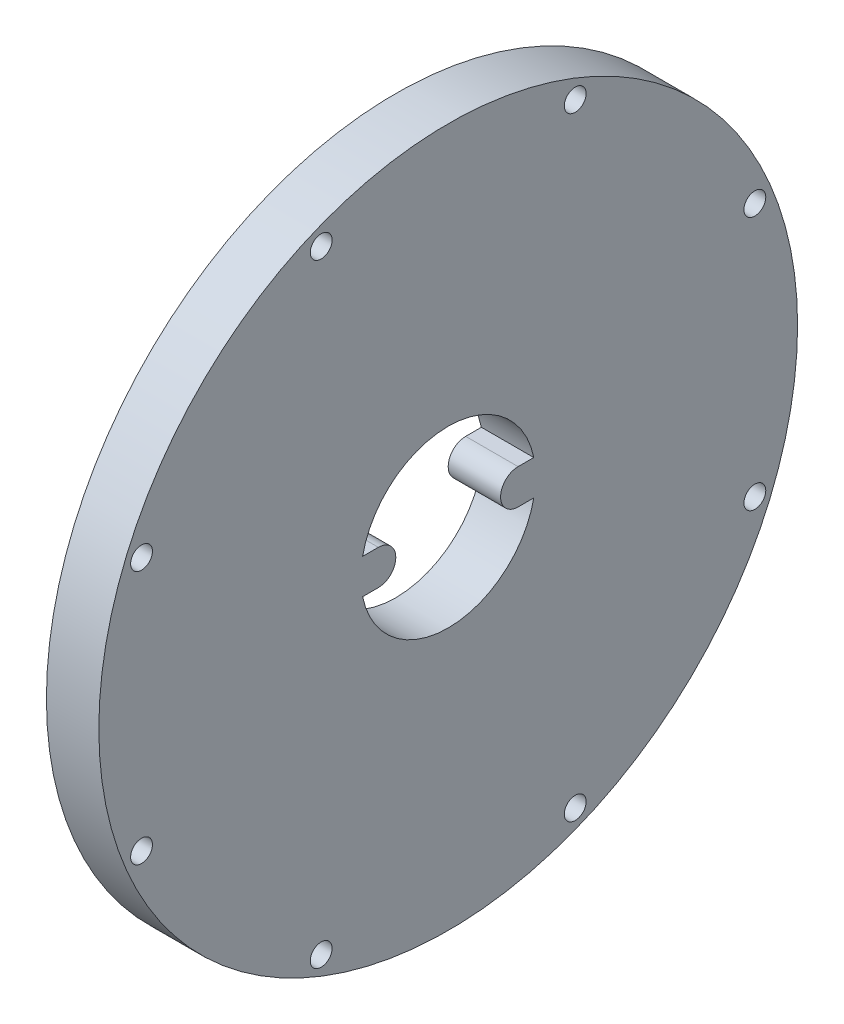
ISO-10303-21;
HEADER;
FILE_DESCRIPTION(('STEP AP214'),'2;1');
FILE_NAME('part.step','',(''),(''),'','','');
FILE_SCHEMA(('AUTOMOTIVE_DESIGN { 1 0 10303 214 1 1 1 1 }'));
ENDSEC;
DATA;
#1=APPLICATION_CONTEXT('core data for automotive mechanical design processes');
#2=APPLICATION_PROTOCOL_DEFINITION('international standard','automotive_design',2000,#1);
#3=PRODUCT_CONTEXT('',#1,'mechanical');
#4=PRODUCT('Part','Part','',(#3));
#5=PRODUCT_RELATED_PRODUCT_CATEGORY('part','',(#4));
#6=PRODUCT_DEFINITION_FORMATION('','',#4);
#7=PRODUCT_DEFINITION_CONTEXT('part definition',#1,'design');
#8=PRODUCT_DEFINITION('design','',#6,#7);
#9=PRODUCT_DEFINITION_SHAPE('','',#8);
#10=(LENGTH_UNIT() NAMED_UNIT(*) SI_UNIT(.MILLI.,.METRE.));
#11=(NAMED_UNIT(*) PLANE_ANGLE_UNIT() SI_UNIT($,.RADIAN.));
#12=(NAMED_UNIT(*) SI_UNIT($,.STERADIAN.) SOLID_ANGLE_UNIT());
#13=UNCERTAINTY_MEASURE_WITH_UNIT(LENGTH_MEASURE(1.E-05),#10,'distance_accuracy_value','');
#14=(GEOMETRIC_REPRESENTATION_CONTEXT(3) GLOBAL_UNCERTAINTY_ASSIGNED_CONTEXT((#13)) GLOBAL_UNIT_ASSIGNED_CONTEXT((#10,
#11,#12)) REPRESENTATION_CONTEXT('',''));
#15=CARTESIAN_POINT('',(0.,0.,0.));
#16=DIRECTION('',(0.,0.,1.));
#17=DIRECTION('',(1.,0.,0.));
#18=AXIS2_PLACEMENT_3D('',#15,#16,#17);
#19=CARTESIAN_POINT('',(12.,70.2148444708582,29.0839408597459));
#20=DIRECTION('',(-1.,0.,0.));
#21=DIRECTION('',(0.,0.,1.));
#22=AXIS2_PLACEMENT_3D('',#19,#20,#21);
#23=CYLINDRICAL_SURFACE('',#22,1.5);
#24=CARTESIAN_POINT('',(0.,70.2148444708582,29.0839408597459));
#25=DIRECTION('',(1.,0.,0.));
#26=DIRECTION('',(0.,0.,-1.));
#27=AXIS2_PLACEMENT_3D('',#24,#25,#26);
#28=CIRCLE('',#27,1.5);
#29=CARTESIAN_POINT('',(0.,70.2148444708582,27.5839408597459));
#30=VERTEX_POINT('',#29);
#31=EDGE_CURVE('E176',#30,#30,#28,.T.);
#32=ORIENTED_EDGE('',*,*,#31,.F.);
#33=EDGE_LOOP('',(#32));
#34=FACE_BOUND('',#33,.T.);
#35=CARTESIAN_POINT('',(7.,70.2148444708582,29.0839408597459));
#36=DIRECTION('',(1.,0.,0.));
#37=DIRECTION('',(0.,0.,-1.));
#38=AXIS2_PLACEMENT_3D('',#35,#36,#37);
#39=CIRCLE('',#38,1.5);
#40=CARTESIAN_POINT('',(7.,70.2148444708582,27.5839408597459));
#41=VERTEX_POINT('',#40);
#42=EDGE_CURVE('E41',#41,#41,#39,.T.);
#43=ORIENTED_EDGE('',*,*,#42,.T.);
#44=EDGE_LOOP('',(#43));
#45=FACE_BOUND('',#44,.T.);
#46=ADVANCED_FACE('F37',(#34,#45),#23,.F.);
#47=CARTESIAN_POINT('',(12.,29.0839408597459,70.2148444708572));
#48=DIRECTION('',(-1.,0.,0.));
#49=DIRECTION('',(0.,0.,1.));
#50=AXIS2_PLACEMENT_3D('',#47,#48,#49);
#51=CYLINDRICAL_SURFACE('',#50,1.50000000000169);
#52=CARTESIAN_POINT('',(0.,29.0839408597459,70.2148444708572));
#53=DIRECTION('',(1.,0.,0.));
#54=DIRECTION('',(0.,0.,-1.));
#55=AXIS2_PLACEMENT_3D('',#52,#53,#54);
#56=CIRCLE('',#55,1.50000000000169);
#57=CARTESIAN_POINT('',(0.,29.0839408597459,68.7148444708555));
#58=VERTEX_POINT('',#57);
#59=EDGE_CURVE('E245',#58,#58,#56,.T.);
#60=ORIENTED_EDGE('',*,*,#59,.F.);
#61=EDGE_LOOP('',(#60));
#62=FACE_BOUND('',#61,.T.);
#63=CARTESIAN_POINT('',(7.,29.0839408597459,70.2148444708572));
#64=DIRECTION('',(1.,0.,0.));
#65=DIRECTION('',(0.,0.,-1.));
#66=AXIS2_PLACEMENT_3D('',#63,#64,#65);
#67=CIRCLE('',#66,1.50000000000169);
#68=CARTESIAN_POINT('',(7.,29.0839408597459,68.7148444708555));
#69=VERTEX_POINT('',#68);
#70=EDGE_CURVE('E202',#69,#69,#67,.T.);
#71=ORIENTED_EDGE('',*,*,#70,.T.);
#72=EDGE_LOOP('',(#71));
#73=FACE_BOUND('',#72,.T.);
#74=ADVANCED_FACE('F312',(#62,#73),#51,.F.);
#75=CARTESIAN_POINT('',(12.,-29.0839408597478,70.2148444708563));
#76=DIRECTION('',(-1.,0.,0.));
#77=DIRECTION('',(0.,0.,1.));
#78=AXIS2_PLACEMENT_3D('',#75,#76,#77);
#79=CYLINDRICAL_SURFACE('',#78,1.50000000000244);
#80=CARTESIAN_POINT('',(0.,-29.0839408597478,70.2148444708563));
#81=DIRECTION('',(1.,0.,0.));
#82=DIRECTION('',(0.,0.,-1.));
#83=AXIS2_PLACEMENT_3D('',#80,#81,#82);
#84=CIRCLE('',#83,1.50000000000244);
#85=CARTESIAN_POINT('',(0.,-29.0839408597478,68.7148444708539));
#86=VERTEX_POINT('',#85);
#87=EDGE_CURVE('E248',#86,#86,#84,.T.);
#88=ORIENTED_EDGE('',*,*,#87,.F.);
#89=EDGE_LOOP('',(#88));
#90=FACE_BOUND('',#89,.T.);
#91=CARTESIAN_POINT('',(7.,-29.0839408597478,70.2148444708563));
#92=DIRECTION('',(1.,0.,0.));
#93=DIRECTION('',(0.,0.,-1.));
#94=AXIS2_PLACEMENT_3D('',#91,#92,#93);
#95=CIRCLE('',#94,1.50000000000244);
#96=CARTESIAN_POINT('',(7.,-29.0839408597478,68.7148444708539));
#97=VERTEX_POINT('',#96);
#98=EDGE_CURVE('E198',#97,#97,#95,.T.);
#99=ORIENTED_EDGE('',*,*,#98,.T.);
#100=EDGE_LOOP('',(#99));
#101=FACE_BOUND('',#100,.T.);
#102=ADVANCED_FACE('F353',(#90,#101),#79,.F.);
#103=CARTESIAN_POINT('',(12.,-70.2148444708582,29.0839408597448));
#104=DIRECTION('',(-1.,0.,0.));
#105=DIRECTION('',(0.,0.,1.));
#106=AXIS2_PLACEMENT_3D('',#103,#104,#105);
#107=CYLINDRICAL_SURFACE('',#106,1.50000000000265);
#108=CARTESIAN_POINT('',(0.,-70.2148444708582,29.0839408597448));
#109=DIRECTION('',(1.,0.,0.));
#110=DIRECTION('',(0.,0.,-1.));
#111=AXIS2_PLACEMENT_3D('',#108,#109,#110);
#112=CIRCLE('',#111,1.50000000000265);
#113=CARTESIAN_POINT('',(0.,-70.2148444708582,27.5839408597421));
#114=VERTEX_POINT('',#113);
#115=EDGE_CURVE('E251',#114,#114,#112,.T.);
#116=ORIENTED_EDGE('',*,*,#115,.F.);
#117=EDGE_LOOP('',(#116));
#118=FACE_BOUND('',#117,.T.);
#119=CARTESIAN_POINT('',(7.,-70.2148444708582,29.0839408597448));
#120=DIRECTION('',(1.,0.,0.));
#121=DIRECTION('',(0.,0.,-1.));
#122=AXIS2_PLACEMENT_3D('',#119,#120,#121);
#123=CIRCLE('',#122,1.50000000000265);
#124=CARTESIAN_POINT('',(7.,-70.2148444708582,27.5839408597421));
#125=VERTEX_POINT('',#124);
#126=EDGE_CURVE('E193',#125,#125,#123,.T.);
#127=ORIENTED_EDGE('',*,*,#126,.T.);
#128=EDGE_LOOP('',(#127));
#129=FACE_BOUND('',#128,.T.);
#130=ADVANCED_FACE('F357',(#118,#129),#107,.F.);
#131=CARTESIAN_POINT('',(12.,-70.2148444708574,-29.0839408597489));
#132=DIRECTION('',(-1.,0.,0.));
#133=DIRECTION('',(0.,0.,1.));
#134=AXIS2_PLACEMENT_3D('',#131,#132,#133);
#135=CYLINDRICAL_SURFACE('',#134,1.50000000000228);
#136=CARTESIAN_POINT('',(0.,-70.2148444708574,-29.0839408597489));
#137=DIRECTION('',(1.,0.,0.));
#138=DIRECTION('',(0.,0.,-1.));
#139=AXIS2_PLACEMENT_3D('',#136,#137,#138);
#140=CIRCLE('',#139,1.50000000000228);
#141=CARTESIAN_POINT('',(0.,-70.2148444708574,-30.5839408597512));
#142=VERTEX_POINT('',#141);
#143=EDGE_CURVE('E254',#142,#142,#140,.T.);
#144=ORIENTED_EDGE('',*,*,#143,.F.);
#145=EDGE_LOOP('',(#144));
#146=FACE_BOUND('',#145,.T.);
#147=CARTESIAN_POINT('',(7.,-70.2148444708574,-29.0839408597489));
#148=DIRECTION('',(1.,0.,0.));
#149=DIRECTION('',(0.,0.,-1.));
#150=AXIS2_PLACEMENT_3D('',#147,#148,#149);
#151=CIRCLE('',#150,1.50000000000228);
#152=CARTESIAN_POINT('',(7.,-70.2148444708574,-30.5839408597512));
#153=VERTEX_POINT('',#152);
#154=EDGE_CURVE('E188',#153,#153,#151,.T.);
#155=ORIENTED_EDGE('',*,*,#154,.T.);
#156=EDGE_LOOP('',(#155));
#157=FACE_BOUND('',#156,.T.);
#158=ADVANCED_FACE('F361',(#146,#157),#135,.F.);
#159=CARTESIAN_POINT('',(12.,-29.0839408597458,-70.2148444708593));
#160=DIRECTION('',(-1.,0.,0.));
#161=DIRECTION('',(0.,0.,1.));
#162=AXIS2_PLACEMENT_3D('',#159,#160,#161);
#163=CYLINDRICAL_SURFACE('',#162,1.50000000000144);
#164=CARTESIAN_POINT('',(0.,-29.0839408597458,-70.2148444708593));
#165=DIRECTION('',(1.,0.,0.));
#166=DIRECTION('',(0.,0.,-1.));
#167=AXIS2_PLACEMENT_3D('',#164,#165,#166);
#168=CIRCLE('',#167,1.50000000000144);
#169=CARTESIAN_POINT('',(0.,-29.0839408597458,-71.7148444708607));
#170=VERTEX_POINT('',#169);
#171=EDGE_CURVE('E257',#170,#170,#168,.T.);
#172=ORIENTED_EDGE('',*,*,#171,.F.);
#173=EDGE_LOOP('',(#172));
#174=FACE_BOUND('',#173,.T.);
#175=CARTESIAN_POINT('',(7.,-29.0839408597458,-70.2148444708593));
#176=DIRECTION('',(1.,0.,0.));
#177=DIRECTION('',(0.,0.,-1.));
#178=AXIS2_PLACEMENT_3D('',#175,#176,#177);
#179=CIRCLE('',#178,1.50000000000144);
#180=CARTESIAN_POINT('',(7.,-29.0839408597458,-71.7148444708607));
#181=VERTEX_POINT('',#180);
#182=EDGE_CURVE('E183',#181,#181,#179,.T.);
#183=ORIENTED_EDGE('',*,*,#182,.T.);
#184=EDGE_LOOP('',(#183));
#185=FACE_BOUND('',#184,.T.);
#186=ADVANCED_FACE('F365',(#174,#185),#163,.F.);
#187=CARTESIAN_POINT('',(12.,29.0839408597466,-70.2148444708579));
#188=DIRECTION('',(-1.,0.,0.));
#189=DIRECTION('',(0.,0.,1.));
#190=AXIS2_PLACEMENT_3D('',#187,#188,#189);
#191=CYLINDRICAL_SURFACE('',#190,1.5);
#192=CARTESIAN_POINT('',(0.,29.0839408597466,-70.2148444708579));
#193=DIRECTION('',(1.,0.,0.));
#194=DIRECTION('',(0.,0.,-1.));
#195=AXIS2_PLACEMENT_3D('',#192,#193,#194);
#196=CIRCLE('',#195,1.5);
#197=CARTESIAN_POINT('',(0.,29.0839408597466,-71.7148444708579));
#198=VERTEX_POINT('',#197);
#199=EDGE_CURVE('E260',#198,#198,#196,.T.);
#200=ORIENTED_EDGE('',*,*,#199,.F.);
#201=EDGE_LOOP('',(#200));
#202=FACE_BOUND('',#201,.T.);
#203=CARTESIAN_POINT('',(7.,29.0839408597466,-70.2148444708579));
#204=DIRECTION('',(1.,0.,0.));
#205=DIRECTION('',(0.,0.,-1.));
#206=AXIS2_PLACEMENT_3D('',#203,#204,#205);
#207=CIRCLE('',#206,1.5);
#208=CARTESIAN_POINT('',(7.,29.0839408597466,-71.7148444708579));
#209=VERTEX_POINT('',#208);
#210=EDGE_CURVE('E178',#209,#209,#207,.T.);
#211=ORIENTED_EDGE('',*,*,#210,.T.);
#212=EDGE_LOOP('',(#211));
#213=FACE_BOUND('',#212,.T.);
#214=ADVANCED_FACE('F271',(#202,#213),#191,.F.);
#215=CARTESIAN_POINT('',(12.,70.2148444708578,-29.0839408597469));
#216=DIRECTION('',(-1.,0.,0.));
#217=DIRECTION('',(0.,0.,1.));
#218=AXIS2_PLACEMENT_3D('',#215,#216,#217);
#219=CYLINDRICAL_SURFACE('',#218,1.5);
#220=CARTESIAN_POINT('',(0.,70.2148444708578,-29.0839408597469));
#221=DIRECTION('',(1.,0.,0.));
#222=DIRECTION('',(0.,0.,-1.));
#223=AXIS2_PLACEMENT_3D('',#220,#221,#222);
#224=CIRCLE('',#223,1.5);
#225=CARTESIAN_POINT('',(0.,70.2148444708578,-30.5839408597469));
#226=VERTEX_POINT('',#225);
#227=EDGE_CURVE('E141',#226,#226,#224,.T.);
#228=ORIENTED_EDGE('',*,*,#227,.F.);
#229=EDGE_LOOP('',(#228));
#230=FACE_BOUND('',#229,.T.);
#231=CARTESIAN_POINT('',(7.,70.2148444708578,-29.0839408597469));
#232=DIRECTION('',(1.,0.,0.));
#233=DIRECTION('',(0.,0.,-1.));
#234=AXIS2_PLACEMENT_3D('',#231,#232,#233);
#235=CIRCLE('',#234,1.5);
#236=CARTESIAN_POINT('',(7.,70.2148444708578,-30.5839408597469));
#237=VERTEX_POINT('',#236);
#238=EDGE_CURVE('E173',#237,#237,#235,.T.);
#239=ORIENTED_EDGE('',*,*,#238,.T.);
#240=EDGE_LOOP('',(#239));
#241=FACE_BOUND('',#240,.T.);
#242=ADVANCED_FACE('F268',(#230,#241),#219,.F.);
#243=CARTESIAN_POINT('',(12.,0.,0.));
#244=DIRECTION('',(1.,0.,0.));
#245=DIRECTION('',(0.,0.,-1.));
#246=AXIS2_PLACEMENT_3D('',#243,#244,#245);
#247=PLANE('',#246);
#248=CARTESIAN_POINT('',(12.,70.2148444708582,29.0839408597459));
#249=DIRECTION('',(1.,0.,0.));
#250=DIRECTION('',(0.,0.,-1.));
#251=AXIS2_PLACEMENT_3D('',#248,#249,#250);
#252=CIRCLE('',#251,2.50000000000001);
#253=CARTESIAN_POINT('',(12.,70.2148444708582,26.5839408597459));
#254=VERTEX_POINT('',#253);
#255=EDGE_CURVE('E218',#254,#254,#252,.T.);
#256=ORIENTED_EDGE('',*,*,#255,.F.);
#257=EDGE_LOOP('',(#256));
#258=FACE_BOUND('',#257,.T.);
#259=CARTESIAN_POINT('',(12.,29.0839408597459,70.2148444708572));
#260=DIRECTION('',(1.,0.,0.));
#261=DIRECTION('',(0.,0.,-1.));
#262=AXIS2_PLACEMENT_3D('',#259,#260,#261);
#263=CIRCLE('',#262,2.50000000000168);
#264=CARTESIAN_POINT('',(12.,29.0839408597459,67.7148444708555));
#265=VERTEX_POINT('',#264);
#266=EDGE_CURVE('E211',#265,#265,#263,.T.);
#267=ORIENTED_EDGE('',*,*,#266,.F.);
#268=EDGE_LOOP('',(#267));
#269=FACE_BOUND('',#268,.T.);
#270=CARTESIAN_POINT('',(12.,-29.0839408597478,70.2148444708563));
#271=DIRECTION('',(1.,0.,0.));
#272=DIRECTION('',(0.,0.,-1.));
#273=AXIS2_PLACEMENT_3D('',#270,#271,#272);
#274=CIRCLE('',#273,2.50000000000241);
#275=CARTESIAN_POINT('',(12.,-29.0839408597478,67.7148444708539));
#276=VERTEX_POINT('',#275);
#277=EDGE_CURVE('E204',#276,#276,#274,.T.);
#278=ORIENTED_EDGE('',*,*,#277,.F.);
#279=EDGE_LOOP('',(#278));
#280=FACE_BOUND('',#279,.T.);
#281=CARTESIAN_POINT('',(12.,-70.2148444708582,29.0839408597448));
#282=DIRECTION('',(1.,0.,0.));
#283=DIRECTION('',(0.,0.,-1.));
#284=AXIS2_PLACEMENT_3D('',#281,#282,#283);
#285=CIRCLE('',#284,2.50000000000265);
#286=CARTESIAN_POINT('',(12.,-70.2148444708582,26.5839408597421));
#287=VERTEX_POINT('',#286);
#288=EDGE_CURVE('E200',#287,#287,#285,.T.);
#289=ORIENTED_EDGE('',*,*,#288,.F.);
#290=EDGE_LOOP('',(#289));
#291=FACE_BOUND('',#290,.T.);
#292=CARTESIAN_POINT('',(12.,-70.2148444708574,-29.0839408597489));
#293=DIRECTION('',(1.,0.,0.));
#294=DIRECTION('',(0.,0.,-1.));
#295=AXIS2_PLACEMENT_3D('',#292,#293,#294);
#296=CIRCLE('',#295,2.50000000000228);
#297=CARTESIAN_POINT('',(12.,-70.2148444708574,-31.5839408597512));
#298=VERTEX_POINT('',#297);
#299=EDGE_CURVE('E196',#298,#298,#296,.T.);
#300=ORIENTED_EDGE('',*,*,#299,.F.);
#301=EDGE_LOOP('',(#300));
#302=FACE_BOUND('',#301,.T.);
#303=CARTESIAN_POINT('',(12.,-29.0839408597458,-70.2148444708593));
#304=DIRECTION('',(1.,0.,0.));
#305=DIRECTION('',(0.,0.,-1.));
#306=AXIS2_PLACEMENT_3D('',#303,#304,#305);
#307=CIRCLE('',#306,2.50000000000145);
#308=CARTESIAN_POINT('',(12.,-29.0839408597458,-72.7148444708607));
#309=VERTEX_POINT('',#308);
#310=EDGE_CURVE('E191',#309,#309,#307,.T.);
#311=ORIENTED_EDGE('',*,*,#310,.F.);
#312=EDGE_LOOP('',(#311));
#313=FACE_BOUND('',#312,.T.);
#314=CARTESIAN_POINT('',(12.,29.0839408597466,-70.2148444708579));
#315=DIRECTION('',(1.,0.,0.));
#316=DIRECTION('',(0.,0.,-1.));
#317=AXIS2_PLACEMENT_3D('',#314,#315,#316);
#318=CIRCLE('',#317,2.5);
#319=CARTESIAN_POINT('',(12.,29.0839408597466,-72.7148444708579));
#320=VERTEX_POINT('',#319);
#321=EDGE_CURVE('E186',#320,#320,#318,.T.);
#322=ORIENTED_EDGE('',*,*,#321,.F.);
#323=EDGE_LOOP('',(#322));
#324=FACE_BOUND('',#323,.T.);
#325=CARTESIAN_POINT('',(12.,70.2148444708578,-29.0839408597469));
#326=DIRECTION('',(1.,0.,0.));
#327=DIRECTION('',(0.,0.,-1.));
#328=AXIS2_PLACEMENT_3D('',#325,#326,#327);
#329=CIRCLE('',#328,2.5);
#330=CARTESIAN_POINT('',(12.,70.2148444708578,-31.5839408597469));
#331=VERTEX_POINT('',#330);
#332=EDGE_CURVE('E181',#331,#331,#329,.T.);
#333=ORIENTED_EDGE('',*,*,#332,.F.);
#334=EDGE_LOOP('',(#333));
#335=FACE_BOUND('',#334,.T.);
#336=CARTESIAN_POINT('',(12.,0.,0.));
#337=DIRECTION('',(1.,0.,0.));
#338=DIRECTION('',(0.,0.,-1.));
#339=AXIS2_PLACEMENT_3D('',#336,#337,#338);
#340=CIRCLE('',#339,80.);
#341=CARTESIAN_POINT('',(12.,0.,-80.));
#342=VERTEX_POINT('',#341);
#343=EDGE_CURVE('E11',#342,#342,#340,.T.);
#344=ORIENTED_EDGE('',*,*,#343,.T.);
#345=EDGE_LOOP('',(#344));
#346=FACE_BOUND('',#345,.T.);
#347=DIRECTION('',(0.,0.,1.));
#348=VECTOR('',#347,1.);
#349=CARTESIAN_POINT('',(12.,-4.,16.));
#350=LINE('',#349,#348);
#351=CARTESIAN_POINT('',(12.,-4.,16.));
#352=VERTEX_POINT('',#351);
#353=CARTESIAN_POINT('',(12.,-4.,19.5959179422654));
#354=VERTEX_POINT('',#353);
#355=EDGE_CURVE('E112',#352,#354,#350,.T.);
#356=ORIENTED_EDGE('',*,*,#355,.F.);
#357=CARTESIAN_POINT('',(12.,0.,16.));
#358=DIRECTION('',(-1.,0.,0.));
#359=DIRECTION('',(0.,0.,-1.));
#360=AXIS2_PLACEMENT_3D('',#357,#358,#359);
#361=CIRCLE('',#360,4.);
#362=CARTESIAN_POINT('',(12.,4.,16.));
#363=VERTEX_POINT('',#362);
#364=EDGE_CURVE('E104',#363,#352,#361,.T.);
#365=ORIENTED_EDGE('',*,*,#364,.F.);
#366=DIRECTION('',(0.,0.,-1.));
#367=VECTOR('',#366,1.);
#368=CARTESIAN_POINT('',(12.,4.,16.));
#369=LINE('',#368,#367);
#370=CARTESIAN_POINT('',(12.,4.,19.5959179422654));
#371=VERTEX_POINT('',#370);
#372=EDGE_CURVE('E138',#371,#363,#369,.T.);
#373=ORIENTED_EDGE('',*,*,#372,.F.);
#374=CARTESIAN_POINT('',(12.,0.,0.));
#375=DIRECTION('',(1.,0.,0.));
#376=DIRECTION('',(0.,0.,-1.));
#377=AXIS2_PLACEMENT_3D('',#374,#375,#376);
#378=CIRCLE('',#377,20.);
#379=CARTESIAN_POINT('',(12.,4.,-19.5959179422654));
#380=VERTEX_POINT('',#379);
#381=EDGE_CURVE('E136',#380,#371,#378,.T.);
#382=ORIENTED_EDGE('',*,*,#381,.F.);
#383=DIRECTION('',(0.,0.,-1.));
#384=VECTOR('',#383,1.);
#385=CARTESIAN_POINT('',(12.,4.,-16.));
#386=LINE('',#385,#384);
#387=CARTESIAN_POINT('',(12.,4.,-16.));
#388=VERTEX_POINT('',#387);
#389=EDGE_CURVE('E134',#388,#380,#386,.T.);
#390=ORIENTED_EDGE('',*,*,#389,.F.);
#391=CARTESIAN_POINT('',(12.,0.,-16.));
#392=DIRECTION('',(-1.,0.,0.));
#393=DIRECTION('',(0.,0.,1.));
#394=AXIS2_PLACEMENT_3D('',#391,#392,#393);
#395=CIRCLE('',#394,4.);
#396=CARTESIAN_POINT('',(12.,-4.,-16.));
#397=VERTEX_POINT('',#396);
#398=EDGE_CURVE('E132',#397,#388,#395,.T.);
#399=ORIENTED_EDGE('',*,*,#398,.F.);
#400=DIRECTION('',(0.,0.,1.));
#401=VECTOR('',#400,1.);
#402=CARTESIAN_POINT('',(12.,-4.,-16.));
#403=LINE('',#402,#401);
#404=CARTESIAN_POINT('',(12.,-4.,-19.5959179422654));
#405=VERTEX_POINT('',#404);
#406=EDGE_CURVE('E127',#405,#397,#403,.T.);
#407=ORIENTED_EDGE('',*,*,#406,.F.);
#408=CARTESIAN_POINT('',(12.,0.,0.));
#409=DIRECTION('',(1.,0.,0.));
#410=DIRECTION('',(0.,0.,-1.));
#411=AXIS2_PLACEMENT_3D('',#408,#409,#410);
#412=CIRCLE('',#411,20.);
#413=EDGE_CURVE('E125',#354,#405,#412,.T.);
#414=ORIENTED_EDGE('',*,*,#413,.F.);
#415=EDGE_LOOP('',(#356,#365,#373,#382,#390,#399,#407,#414));
#416=FACE_BOUND('',#415,.T.);
#417=ADVANCED_FACE('F123',(#258,#269,#280,#291,#302,#313,#324,#335,#346,#416),#247,.T.);
#418=CARTESIAN_POINT('',(0.,0.,0.));
#419=DIRECTION('',(1.,0.,0.));
#420=DIRECTION('',(0.,0.,-1.));
#421=AXIS2_PLACEMENT_3D('',#418,#419,#420);
#422=PLANE('',#421);
#423=ORIENTED_EDGE('',*,*,#59,.T.);
#424=EDGE_LOOP('',(#423));
#425=FACE_BOUND('',#424,.T.);
#426=ORIENTED_EDGE('',*,*,#115,.T.);
#427=EDGE_LOOP('',(#426));
#428=FACE_BOUND('',#427,.T.);
#429=ORIENTED_EDGE('',*,*,#171,.T.);
#430=EDGE_LOOP('',(#429));
#431=FACE_BOUND('',#430,.T.);
#432=ORIENTED_EDGE('',*,*,#227,.T.);
#433=EDGE_LOOP('',(#432));
#434=FACE_BOUND('',#433,.T.);
#435=CARTESIAN_POINT('',(0.,0.,0.));
#436=DIRECTION('',(1.,0.,0.));
#437=DIRECTION('',(0.,0.,-1.));
#438=AXIS2_PLACEMENT_3D('',#435,#436,#437);
#439=CIRCLE('',#438,80.);
#440=CARTESIAN_POINT('',(0.,0.,-80.));
#441=VERTEX_POINT('',#440);
#442=EDGE_CURVE('E46',#441,#441,#439,.T.);
#443=ORIENTED_EDGE('',*,*,#442,.F.);
#444=EDGE_LOOP('',(#443));
#445=FACE_BOUND('',#444,.T.);
#446=CARTESIAN_POINT('',(0.,0.,16.));
#447=DIRECTION('',(-1.,0.,0.));
#448=DIRECTION('',(0.,0.,-1.));
#449=AXIS2_PLACEMENT_3D('',#446,#447,#448);
#450=CIRCLE('',#449,4.);
#451=CARTESIAN_POINT('',(0.,4.,16.));
#452=VERTEX_POINT('',#451);
#453=CARTESIAN_POINT('',(0.,-4.,16.));
#454=VERTEX_POINT('',#453);
#455=EDGE_CURVE('E62',#452,#454,#450,.T.);
#456=ORIENTED_EDGE('',*,*,#455,.T.);
#457=DIRECTION('',(0.,0.,1.));
#458=VECTOR('',#457,1.);
#459=CARTESIAN_POINT('',(0.,-4.,16.));
#460=LINE('',#459,#458);
#461=CARTESIAN_POINT('',(0.,-4.,19.5959179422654));
#462=VERTEX_POINT('',#461);
#463=EDGE_CURVE('E119',#454,#462,#460,.T.);
#464=ORIENTED_EDGE('',*,*,#463,.T.);
#465=CARTESIAN_POINT('',(0.,0.,0.));
#466=DIRECTION('',(1.,0.,0.));
#467=DIRECTION('',(0.,0.,-1.));
#468=AXIS2_PLACEMENT_3D('',#465,#466,#467);
#469=CIRCLE('',#468,20.);
#470=CARTESIAN_POINT('',(0.,-4.,-19.5959179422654));
#471=VERTEX_POINT('',#470);
#472=EDGE_CURVE('E143',#462,#471,#469,.T.);
#473=ORIENTED_EDGE('',*,*,#472,.T.);
#474=DIRECTION('',(0.,0.,1.));
#475=VECTOR('',#474,1.);
#476=CARTESIAN_POINT('',(0.,-4.,-16.));
#477=LINE('',#476,#475);
#478=CARTESIAN_POINT('',(0.,-4.,-16.));
#479=VERTEX_POINT('',#478);
#480=EDGE_CURVE('E146',#471,#479,#477,.T.);
#481=ORIENTED_EDGE('',*,*,#480,.T.);
#482=CARTESIAN_POINT('',(0.,0.,-16.));
#483=DIRECTION('',(-1.,0.,0.));
#484=DIRECTION('',(0.,0.,1.));
#485=AXIS2_PLACEMENT_3D('',#482,#483,#484);
#486=CIRCLE('',#485,4.);
#487=CARTESIAN_POINT('',(0.,4.,-16.));
#488=VERTEX_POINT('',#487);
#489=EDGE_CURVE('E149',#479,#488,#486,.T.);
#490=ORIENTED_EDGE('',*,*,#489,.T.);
#491=DIRECTION('',(0.,0.,-1.));
#492=VECTOR('',#491,1.);
#493=CARTESIAN_POINT('',(0.,4.,-16.));
#494=LINE('',#493,#492);
#495=CARTESIAN_POINT('',(0.,4.,-19.5959179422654));
#496=VERTEX_POINT('',#495);
#497=EDGE_CURVE('E152',#488,#496,#494,.T.);
#498=ORIENTED_EDGE('',*,*,#497,.T.);
#499=CARTESIAN_POINT('',(0.,0.,0.));
#500=DIRECTION('',(1.,0.,0.));
#501=DIRECTION('',(0.,0.,-1.));
#502=AXIS2_PLACEMENT_3D('',#499,#500,#501);
#503=CIRCLE('',#502,20.);
#504=CARTESIAN_POINT('',(0.,4.,19.5959179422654));
#505=VERTEX_POINT('',#504);
#506=EDGE_CURVE('E155',#496,#505,#503,.T.);
#507=ORIENTED_EDGE('',*,*,#506,.T.);
#508=DIRECTION('',(0.,0.,-1.));
#509=VECTOR('',#508,1.);
#510=CARTESIAN_POINT('',(0.,4.,16.));
#511=LINE('',#510,#509);
#512=EDGE_CURVE('E113',#505,#452,#511,.T.);
#513=ORIENTED_EDGE('',*,*,#512,.T.);
#514=EDGE_LOOP('',(#456,#464,#473,#481,#490,#498,#507,#513));
#515=FACE_BOUND('',#514,.T.);
#516=ORIENTED_EDGE('',*,*,#199,.T.);
#517=EDGE_LOOP('',(#516));
#518=FACE_BOUND('',#517,.T.);
#519=ORIENTED_EDGE('',*,*,#143,.T.);
#520=EDGE_LOOP('',(#519));
#521=FACE_BOUND('',#520,.T.);
#522=ORIENTED_EDGE('',*,*,#87,.T.);
#523=EDGE_LOOP('',(#522));
#524=FACE_BOUND('',#523,.T.);
#525=ORIENTED_EDGE('',*,*,#31,.T.);
#526=EDGE_LOOP('',(#525));
#527=FACE_BOUND('',#526,.T.);
#528=ADVANCED_FACE('F265',(#425,#428,#431,#434,#445,#515,#518,#521,#524,#527),#422,.F.);
#529=CARTESIAN_POINT('',(12.,0.,0.));
#530=DIRECTION('',(-1.,0.,0.));
#531=DIRECTION('',(0.,0.,1.));
#532=AXIS2_PLACEMENT_3D('',#529,#530,#531);
#533=CYLINDRICAL_SURFACE('',#532,80.);
#534=ORIENTED_EDGE('',*,*,#343,.F.);
#535=EDGE_LOOP('',(#534));
#536=FACE_BOUND('',#535,.T.);
#537=ORIENTED_EDGE('',*,*,#442,.T.);
#538=EDGE_LOOP('',(#537));
#539=FACE_BOUND('',#538,.T.);
#540=ADVANCED_FACE('F39',(#536,#539),#533,.T.);
#541=CARTESIAN_POINT('',(12.,0.,16.));
#542=DIRECTION('',(-1.,0.,0.));
#543=DIRECTION('',(0.,0.,1.));
#544=AXIS2_PLACEMENT_3D('',#541,#542,#543);
#545=CYLINDRICAL_SURFACE('',#544,4.);
#546=ORIENTED_EDGE('',*,*,#455,.F.);
#547=DIRECTION('',(-1.,0.,0.));
#548=VECTOR('',#547,1.);
#549=CARTESIAN_POINT('',(12.,4.,16.));
#550=LINE('',#549,#548);
#551=EDGE_CURVE('E108',#363,#452,#550,.T.);
#552=ORIENTED_EDGE('',*,*,#551,.F.);
#553=ORIENTED_EDGE('',*,*,#364,.T.);
#554=DIRECTION('',(-1.,0.,0.));
#555=VECTOR('',#554,1.);
#556=CARTESIAN_POINT('',(12.,-4.,16.));
#557=LINE('',#556,#555);
#558=EDGE_CURVE('E107',#352,#454,#557,.T.);
#559=ORIENTED_EDGE('',*,*,#558,.T.);
#560=EDGE_LOOP('',(#546,#552,#553,#559));
#561=FACE_BOUND('',#560,.T.);
#562=ADVANCED_FACE('F106',(#561),#545,.T.);
#563=CARTESIAN_POINT('',(12.,-4.,16.));
#564=DIRECTION('',(0.,-1.,0.));
#565=DIRECTION('',(0.,0.,-1.));
#566=AXIS2_PLACEMENT_3D('',#563,#564,#565);
#567=PLANE('',#566);
#568=ORIENTED_EDGE('',*,*,#463,.F.);
#569=ORIENTED_EDGE('',*,*,#558,.F.);
#570=ORIENTED_EDGE('',*,*,#355,.T.);
#571=DIRECTION('',(-1.,0.,0.));
#572=VECTOR('',#571,1.);
#573=CARTESIAN_POINT('',(12.,-4.,19.5959179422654));
#574=LINE('',#573,#572);
#575=EDGE_CURVE('E120',#354,#462,#574,.T.);
#576=ORIENTED_EDGE('',*,*,#575,.T.);
#577=EDGE_LOOP('',(#568,#569,#570,#576));
#578=FACE_BOUND('',#577,.T.);
#579=ADVANCED_FACE('F116',(#578),#567,.T.);
#580=CARTESIAN_POINT('',(12.,0.,0.));
#581=DIRECTION('',(-1.,0.,0.));
#582=DIRECTION('',(0.,0.,1.));
#583=AXIS2_PLACEMENT_3D('',#580,#581,#582);
#584=CYLINDRICAL_SURFACE('',#583,20.);
#585=ORIENTED_EDGE('',*,*,#472,.F.);
#586=ORIENTED_EDGE('',*,*,#575,.F.);
#587=ORIENTED_EDGE('',*,*,#413,.T.);
#588=DIRECTION('',(-1.,0.,0.));
#589=VECTOR('',#588,1.);
#590=CARTESIAN_POINT('',(12.,-4.,-19.5959179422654));
#591=LINE('',#590,#589);
#592=EDGE_CURVE('E168',#405,#471,#591,.T.);
#593=ORIENTED_EDGE('',*,*,#592,.T.);
#594=EDGE_LOOP('',(#585,#586,#587,#593));
#595=FACE_BOUND('',#594,.T.);
#596=ADVANCED_FACE('F390',(#595),#584,.F.);
#597=CARTESIAN_POINT('',(12.,-4.,-16.));
#598=DIRECTION('',(0.,-1.,0.));
#599=DIRECTION('',(0.,0.,-1.));
#600=AXIS2_PLACEMENT_3D('',#597,#598,#599);
#601=PLANE('',#600);
#602=ORIENTED_EDGE('',*,*,#480,.F.);
#603=ORIENTED_EDGE('',*,*,#592,.F.);
#604=ORIENTED_EDGE('',*,*,#406,.T.);
#605=DIRECTION('',(-1.,0.,0.));
#606=VECTOR('',#605,1.);
#607=CARTESIAN_POINT('',(12.,-4.,-16.));
#608=LINE('',#607,#606);
#609=EDGE_CURVE('E166',#397,#479,#608,.T.);
#610=ORIENTED_EDGE('',*,*,#609,.T.);
#611=EDGE_LOOP('',(#602,#603,#604,#610));
#612=FACE_BOUND('',#611,.T.);
#613=ADVANCED_FACE('F386',(#612),#601,.T.);
#614=CARTESIAN_POINT('',(12.,0.,-16.));
#615=DIRECTION('',(-1.,0.,0.));
#616=DIRECTION('',(0.,0.,1.));
#617=AXIS2_PLACEMENT_3D('',#614,#615,#616);
#618=CYLINDRICAL_SURFACE('',#617,4.);
#619=ORIENTED_EDGE('',*,*,#489,.F.);
#620=ORIENTED_EDGE('',*,*,#609,.F.);
#621=ORIENTED_EDGE('',*,*,#398,.T.);
#622=DIRECTION('',(-1.,0.,0.));
#623=VECTOR('',#622,1.);
#624=CARTESIAN_POINT('',(12.,4.,-16.));
#625=LINE('',#624,#623);
#626=EDGE_CURVE('E164',#388,#488,#625,.T.);
#627=ORIENTED_EDGE('',*,*,#626,.T.);
#628=EDGE_LOOP('',(#619,#620,#621,#627));
#629=FACE_BOUND('',#628,.T.);
#630=ADVANCED_FACE('F382',(#629),#618,.T.);
#631=CARTESIAN_POINT('',(12.,4.,-16.));
#632=DIRECTION('',(0.,1.,0.));
#633=DIRECTION('',(0.,0.,1.));
#634=AXIS2_PLACEMENT_3D('',#631,#632,#633);
#635=PLANE('',#634);
#636=ORIENTED_EDGE('',*,*,#497,.F.);
#637=ORIENTED_EDGE('',*,*,#626,.F.);
#638=ORIENTED_EDGE('',*,*,#389,.T.);
#639=DIRECTION('',(-1.,0.,0.));
#640=VECTOR('',#639,1.);
#641=CARTESIAN_POINT('',(12.,4.,-19.5959179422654));
#642=LINE('',#641,#640);
#643=EDGE_CURVE('E162',#380,#496,#642,.T.);
#644=ORIENTED_EDGE('',*,*,#643,.T.);
#645=EDGE_LOOP('',(#636,#637,#638,#644));
#646=FACE_BOUND('',#645,.T.);
#647=ADVANCED_FACE('F378',(#646),#635,.T.);
#648=CARTESIAN_POINT('',(12.,0.,0.));
#649=DIRECTION('',(-1.,0.,0.));
#650=DIRECTION('',(0.,0.,1.));
#651=AXIS2_PLACEMENT_3D('',#648,#649,#650);
#652=CYLINDRICAL_SURFACE('',#651,20.);
#653=ORIENTED_EDGE('',*,*,#506,.F.);
#654=ORIENTED_EDGE('',*,*,#643,.F.);
#655=ORIENTED_EDGE('',*,*,#381,.T.);
#656=DIRECTION('',(-1.,0.,0.));
#657=VECTOR('',#656,1.);
#658=CARTESIAN_POINT('',(12.,4.,19.5959179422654));
#659=LINE('',#658,#657);
#660=EDGE_CURVE('E54',#371,#505,#659,.T.);
#661=ORIENTED_EDGE('',*,*,#660,.T.);
#662=EDGE_LOOP('',(#653,#654,#655,#661));
#663=FACE_BOUND('',#662,.T.);
#664=ADVANCED_FACE('F375',(#663),#652,.F.);
#665=CARTESIAN_POINT('',(12.,4.,16.));
#666=DIRECTION('',(0.,1.,0.));
#667=DIRECTION('',(0.,0.,1.));
#668=AXIS2_PLACEMENT_3D('',#665,#666,#667);
#669=PLANE('',#668);
#670=ORIENTED_EDGE('',*,*,#512,.F.);
#671=ORIENTED_EDGE('',*,*,#660,.F.);
#672=ORIENTED_EDGE('',*,*,#372,.T.);
#673=ORIENTED_EDGE('',*,*,#551,.T.);
#674=EDGE_LOOP('',(#670,#671,#672,#673));
#675=FACE_BOUND('',#674,.T.);
#676=ADVANCED_FACE('F285',(#675),#669,.T.);
#677=CARTESIAN_POINT('',(7.,70.2148444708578,-29.0839408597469));
#678=DIRECTION('',(1.,0.,0.));
#679=DIRECTION('',(0.,0.,-1.));
#680=AXIS2_PLACEMENT_3D('',#677,#678,#679);
#681=CYLINDRICAL_SURFACE('',#680,2.5);
#682=CARTESIAN_POINT('',(7.,70.2148444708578,-29.0839408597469));
#683=DIRECTION('',(1.,0.,0.));
#684=DIRECTION('',(0.,0.,-1.));
#685=AXIS2_PLACEMENT_3D('',#682,#683,#684);
#686=CIRCLE('',#685,2.5);
#687=CARTESIAN_POINT('',(7.,70.2148444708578,-31.5839408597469));
#688=VERTEX_POINT('',#687);
#689=EDGE_CURVE('E177',#688,#688,#686,.T.);
#690=ORIENTED_EDGE('',*,*,#689,.F.);
#691=EDGE_LOOP('',(#690));
#692=FACE_BOUND('',#691,.T.);
#693=ORIENTED_EDGE('',*,*,#332,.T.);
#694=EDGE_LOOP('',(#693));
#695=FACE_BOUND('',#694,.T.);
#696=ADVANCED_FACE('F279',(#692,#695),#681,.F.);
#697=CARTESIAN_POINT('',(7.,70.2148444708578,-29.0839408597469));
#698=DIRECTION('',(1.,0.,0.));
#699=DIRECTION('',(0.,0.,-1.));
#700=AXIS2_PLACEMENT_3D('',#697,#698,#699);
#701=PLANE('',#700);
#702=ORIENTED_EDGE('',*,*,#238,.F.);
#703=EDGE_LOOP('',(#702));
#704=FACE_BOUND('',#703,.T.);
#705=ORIENTED_EDGE('',*,*,#689,.T.);
#706=EDGE_LOOP('',(#705));
#707=FACE_BOUND('',#706,.T.);
#708=ADVANCED_FACE('F275',(#704,#707),#701,.T.);
#709=CARTESIAN_POINT('',(7.,29.0839408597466,-70.2148444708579));
#710=DIRECTION('',(1.,0.,0.));
#711=DIRECTION('',(0.,0.,-1.));
#712=AXIS2_PLACEMENT_3D('',#709,#710,#711);
#713=CYLINDRICAL_SURFACE('',#712,2.5);
#714=CARTESIAN_POINT('',(7.,29.0839408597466,-70.2148444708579));
#715=DIRECTION('',(1.,0.,0.));
#716=DIRECTION('',(0.,0.,-1.));
#717=AXIS2_PLACEMENT_3D('',#714,#715,#716);
#718=CIRCLE('',#717,2.5);
#719=CARTESIAN_POINT('',(7.,29.0839408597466,-72.7148444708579));
#720=VERTEX_POINT('',#719);
#721=EDGE_CURVE('E182',#720,#720,#718,.T.);
#722=ORIENTED_EDGE('',*,*,#721,.F.);
#723=EDGE_LOOP('',(#722));
#724=FACE_BOUND('',#723,.T.);
#725=ORIENTED_EDGE('',*,*,#321,.T.);
#726=EDGE_LOOP('',(#725));
#727=FACE_BOUND('',#726,.T.);
#728=ADVANCED_FACE('F278',(#724,#727),#713,.F.);
#729=CARTESIAN_POINT('',(7.,29.0839408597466,-70.2148444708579));
#730=DIRECTION('',(1.,0.,0.));
#731=DIRECTION('',(0.,0.,-1.));
#732=AXIS2_PLACEMENT_3D('',#729,#730,#731);
#733=PLANE('',#732);
#734=ORIENTED_EDGE('',*,*,#210,.F.);
#735=EDGE_LOOP('',(#734));
#736=FACE_BOUND('',#735,.T.);
#737=ORIENTED_EDGE('',*,*,#721,.T.);
#738=EDGE_LOOP('',(#737));
#739=FACE_BOUND('',#738,.T.);
#740=ADVANCED_FACE('F339',(#736,#739),#733,.T.);
#741=CARTESIAN_POINT('',(7.,-29.0839408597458,-70.2148444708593));
#742=DIRECTION('',(1.,0.,0.));
#743=DIRECTION('',(0.,0.,-1.));
#744=AXIS2_PLACEMENT_3D('',#741,#742,#743);
#745=CYLINDRICAL_SURFACE('',#744,2.50000000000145);
#746=CARTESIAN_POINT('',(7.,-29.0839408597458,-70.2148444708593));
#747=DIRECTION('',(1.,0.,0.));
#748=DIRECTION('',(0.,0.,-1.));
#749=AXIS2_PLACEMENT_3D('',#746,#747,#748);
#750=CIRCLE('',#749,2.50000000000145);
#751=CARTESIAN_POINT('',(7.,-29.0839408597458,-72.7148444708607));
#752=VERTEX_POINT('',#751);
#753=EDGE_CURVE('E187',#752,#752,#750,.T.);
#754=ORIENTED_EDGE('',*,*,#753,.F.);
#755=EDGE_LOOP('',(#754));
#756=FACE_BOUND('',#755,.T.);
#757=ORIENTED_EDGE('',*,*,#310,.T.);
#758=EDGE_LOOP('',(#757));
#759=FACE_BOUND('',#758,.T.);
#760=ADVANCED_FACE('F345',(#756,#759),#745,.F.);
#761=CARTESIAN_POINT('',(7.,-29.0839408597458,-70.2148444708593));
#762=DIRECTION('',(1.,0.,0.));
#763=DIRECTION('',(0.,0.,-1.));
#764=AXIS2_PLACEMENT_3D('',#761,#762,#763);
#765=PLANE('',#764);
#766=ORIENTED_EDGE('',*,*,#182,.F.);
#767=EDGE_LOOP('',(#766));
#768=FACE_BOUND('',#767,.T.);
#769=ORIENTED_EDGE('',*,*,#753,.T.);
#770=EDGE_LOOP('',(#769));
#771=FACE_BOUND('',#770,.T.);
#772=ADVANCED_FACE('F459',(#768,#771),#765,.T.);
#773=CARTESIAN_POINT('',(7.,-70.2148444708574,-29.0839408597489));
#774=DIRECTION('',(1.,0.,0.));
#775=DIRECTION('',(0.,0.,-1.));
#776=AXIS2_PLACEMENT_3D('',#773,#774,#775);
#777=CYLINDRICAL_SURFACE('',#776,2.50000000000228);
#778=CARTESIAN_POINT('',(7.,-70.2148444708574,-29.0839408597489));
#779=DIRECTION('',(1.,0.,0.));
#780=DIRECTION('',(0.,0.,-1.));
#781=AXIS2_PLACEMENT_3D('',#778,#779,#780);
#782=CIRCLE('',#781,2.50000000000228);
#783=CARTESIAN_POINT('',(7.,-70.2148444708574,-31.5839408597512));
#784=VERTEX_POINT('',#783);
#785=EDGE_CURVE('E192',#784,#784,#782,.T.);
#786=ORIENTED_EDGE('',*,*,#785,.F.);
#787=EDGE_LOOP('',(#786));
#788=FACE_BOUND('',#787,.T.);
#789=ORIENTED_EDGE('',*,*,#299,.T.);
#790=EDGE_LOOP('',(#789));
#791=FACE_BOUND('',#790,.T.);
#792=ADVANCED_FACE('F468',(#788,#791),#777,.F.);
#793=CARTESIAN_POINT('',(7.,-70.2148444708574,-29.0839408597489));
#794=DIRECTION('',(1.,0.,0.));
#795=DIRECTION('',(0.,0.,-1.));
#796=AXIS2_PLACEMENT_3D('',#793,#794,#795);
#797=PLANE('',#796);
#798=ORIENTED_EDGE('',*,*,#154,.F.);
#799=EDGE_LOOP('',(#798));
#800=FACE_BOUND('',#799,.T.);
#801=ORIENTED_EDGE('',*,*,#785,.T.);
#802=EDGE_LOOP('',(#801));
#803=FACE_BOUND('',#802,.T.);
#804=ADVANCED_FACE('F478',(#800,#803),#797,.T.);
#805=CARTESIAN_POINT('',(7.,-70.2148444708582,29.0839408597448));
#806=DIRECTION('',(1.,0.,0.));
#807=DIRECTION('',(0.,0.,-1.));
#808=AXIS2_PLACEMENT_3D('',#805,#806,#807);
#809=CYLINDRICAL_SURFACE('',#808,2.50000000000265);
#810=CARTESIAN_POINT('',(7.,-70.2148444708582,29.0839408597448));
#811=DIRECTION('',(1.,0.,0.));
#812=DIRECTION('',(0.,0.,-1.));
#813=AXIS2_PLACEMENT_3D('',#810,#811,#812);
#814=CIRCLE('',#813,2.50000000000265);
#815=CARTESIAN_POINT('',(7.,-70.2148444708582,26.5839408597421));
#816=VERTEX_POINT('',#815);
#817=EDGE_CURVE('E197',#816,#816,#814,.T.);
#818=ORIENTED_EDGE('',*,*,#817,.F.);
#819=EDGE_LOOP('',(#818));
#820=FACE_BOUND('',#819,.T.);
#821=ORIENTED_EDGE('',*,*,#288,.T.);
#822=EDGE_LOOP('',(#821));
#823=FACE_BOUND('',#822,.T.);
#824=ADVANCED_FACE('F488',(#820,#823),#809,.F.);
#825=CARTESIAN_POINT('',(7.,-70.2148444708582,29.0839408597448));
#826=DIRECTION('',(1.,0.,0.));
#827=DIRECTION('',(0.,0.,-1.));
#828=AXIS2_PLACEMENT_3D('',#825,#826,#827);
#829=PLANE('',#828);
#830=ORIENTED_EDGE('',*,*,#126,.F.);
#831=EDGE_LOOP('',(#830));
#832=FACE_BOUND('',#831,.T.);
#833=ORIENTED_EDGE('',*,*,#817,.T.);
#834=EDGE_LOOP('',(#833));
#835=FACE_BOUND('',#834,.T.);
#836=ADVANCED_FACE('F498',(#832,#835),#829,.T.);
#837=CARTESIAN_POINT('',(7.,-29.0839408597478,70.2148444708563));
#838=DIRECTION('',(1.,0.,0.));
#839=DIRECTION('',(0.,0.,-1.));
#840=AXIS2_PLACEMENT_3D('',#837,#838,#839);
#841=CYLINDRICAL_SURFACE('',#840,2.50000000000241);
#842=CARTESIAN_POINT('',(7.,-29.0839408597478,70.2148444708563));
#843=DIRECTION('',(1.,0.,0.));
#844=DIRECTION('',(0.,0.,-1.));
#845=AXIS2_PLACEMENT_3D('',#842,#843,#844);
#846=CIRCLE('',#845,2.50000000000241);
#847=CARTESIAN_POINT('',(7.,-29.0839408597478,67.7148444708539));
#848=VERTEX_POINT('',#847);
#849=EDGE_CURVE('E201',#848,#848,#846,.T.);
#850=ORIENTED_EDGE('',*,*,#849,.F.);
#851=EDGE_LOOP('',(#850));
#852=FACE_BOUND('',#851,.T.);
#853=ORIENTED_EDGE('',*,*,#277,.T.);
#854=EDGE_LOOP('',(#853));
#855=FACE_BOUND('',#854,.T.);
#856=ADVANCED_FACE('F508',(#852,#855),#841,.F.);
#857=CARTESIAN_POINT('',(7.,-29.0839408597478,70.2148444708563));
#858=DIRECTION('',(1.,0.,0.));
#859=DIRECTION('',(0.,0.,-1.));
#860=AXIS2_PLACEMENT_3D('',#857,#858,#859);
#861=PLANE('',#860);
#862=ORIENTED_EDGE('',*,*,#98,.F.);
#863=EDGE_LOOP('',(#862));
#864=FACE_BOUND('',#863,.T.);
#865=ORIENTED_EDGE('',*,*,#849,.T.);
#866=EDGE_LOOP('',(#865));
#867=FACE_BOUND('',#866,.T.);
#868=ADVANCED_FACE('F518',(#864,#867),#861,.T.);
#869=CARTESIAN_POINT('',(7.,29.0839408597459,70.2148444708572));
#870=DIRECTION('',(1.,0.,0.));
#871=DIRECTION('',(0.,0.,-1.));
#872=AXIS2_PLACEMENT_3D('',#869,#870,#871);
#873=CYLINDRICAL_SURFACE('',#872,2.50000000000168);
#874=CARTESIAN_POINT('',(7.,29.0839408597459,70.2148444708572));
#875=DIRECTION('',(1.,0.,0.));
#876=DIRECTION('',(0.,0.,-1.));
#877=AXIS2_PLACEMENT_3D('',#874,#875,#876);
#878=CIRCLE('',#877,2.50000000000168);
#879=CARTESIAN_POINT('',(7.,29.0839408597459,67.7148444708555));
#880=VERTEX_POINT('',#879);
#881=EDGE_CURVE('E205',#880,#880,#878,.T.);
#882=ORIENTED_EDGE('',*,*,#881,.F.);
#883=EDGE_LOOP('',(#882));
#884=FACE_BOUND('',#883,.T.);
#885=ORIENTED_EDGE('',*,*,#266,.T.);
#886=EDGE_LOOP('',(#885));
#887=FACE_BOUND('',#886,.T.);
#888=ADVANCED_FACE('F528',(#884,#887),#873,.F.);
#889=CARTESIAN_POINT('',(7.,29.0839408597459,70.2148444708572));
#890=DIRECTION('',(1.,0.,0.));
#891=DIRECTION('',(0.,0.,-1.));
#892=AXIS2_PLACEMENT_3D('',#889,#890,#891);
#893=PLANE('',#892);
#894=ORIENTED_EDGE('',*,*,#70,.F.);
#895=EDGE_LOOP('',(#894));
#896=FACE_BOUND('',#895,.T.);
#897=ORIENTED_EDGE('',*,*,#881,.T.);
#898=EDGE_LOOP('',(#897));
#899=FACE_BOUND('',#898,.T.);
#900=ADVANCED_FACE('F538',(#896,#899),#893,.T.);
#901=CARTESIAN_POINT('',(7.,70.2148444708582,29.0839408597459));
#902=DIRECTION('',(1.,0.,0.));
#903=DIRECTION('',(0.,0.,-1.));
#904=AXIS2_PLACEMENT_3D('',#901,#902,#903);
#905=CYLINDRICAL_SURFACE('',#904,2.50000000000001);
#906=CARTESIAN_POINT('',(7.,70.2148444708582,29.0839408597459));
#907=DIRECTION('',(1.,0.,0.));
#908=DIRECTION('',(0.,0.,-1.));
#909=AXIS2_PLACEMENT_3D('',#906,#907,#908);
#910=CIRCLE('',#909,2.50000000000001);
#911=CARTESIAN_POINT('',(7.,70.2148444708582,26.5839408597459));
#912=VERTEX_POINT('',#911);
#913=EDGE_CURVE('E317',#912,#912,#910,.T.);
#914=ORIENTED_EDGE('',*,*,#913,.F.);
#915=EDGE_LOOP('',(#914));
#916=FACE_BOUND('',#915,.T.);
#917=ORIENTED_EDGE('',*,*,#255,.T.);
#918=EDGE_LOOP('',(#917));
#919=FACE_BOUND('',#918,.T.);
#920=ADVANCED_FACE('F324',(#916,#919),#905,.F.);
#921=CARTESIAN_POINT('',(7.,70.2148444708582,29.0839408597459));
#922=DIRECTION('',(1.,0.,0.));
#923=DIRECTION('',(0.,0.,-1.));
#924=AXIS2_PLACEMENT_3D('',#921,#922,#923);
#925=PLANE('',#924);
#926=ORIENTED_EDGE('',*,*,#42,.F.);
#927=EDGE_LOOP('',(#926));
#928=FACE_BOUND('',#927,.T.);
#929=ORIENTED_EDGE('',*,*,#913,.T.);
#930=EDGE_LOOP('',(#929));
#931=FACE_BOUND('',#930,.T.);
#932=ADVANCED_FACE('F557',(#928,#931),#925,.T.);
#933=CLOSED_SHELL('',(#46,#74,#102,#130,#158,#186,#214,#242,#417,#528,#540,#562,#579,#596,#613,
#630,#647,#664,#676,#696,#708,#728,#740,#760,#772,#792,#804,#824,#836,#856,#868,#888,#900,#920,#932));
#934=MANIFOLD_SOLID_BREP('B2',#933);
#935=ADVANCED_BREP_SHAPE_REPRESENTATION('',(#18,#934),#14);
#936=SHAPE_DEFINITION_REPRESENTATION(#9,#935);
ENDSEC;
END-ISO-10303-21;
